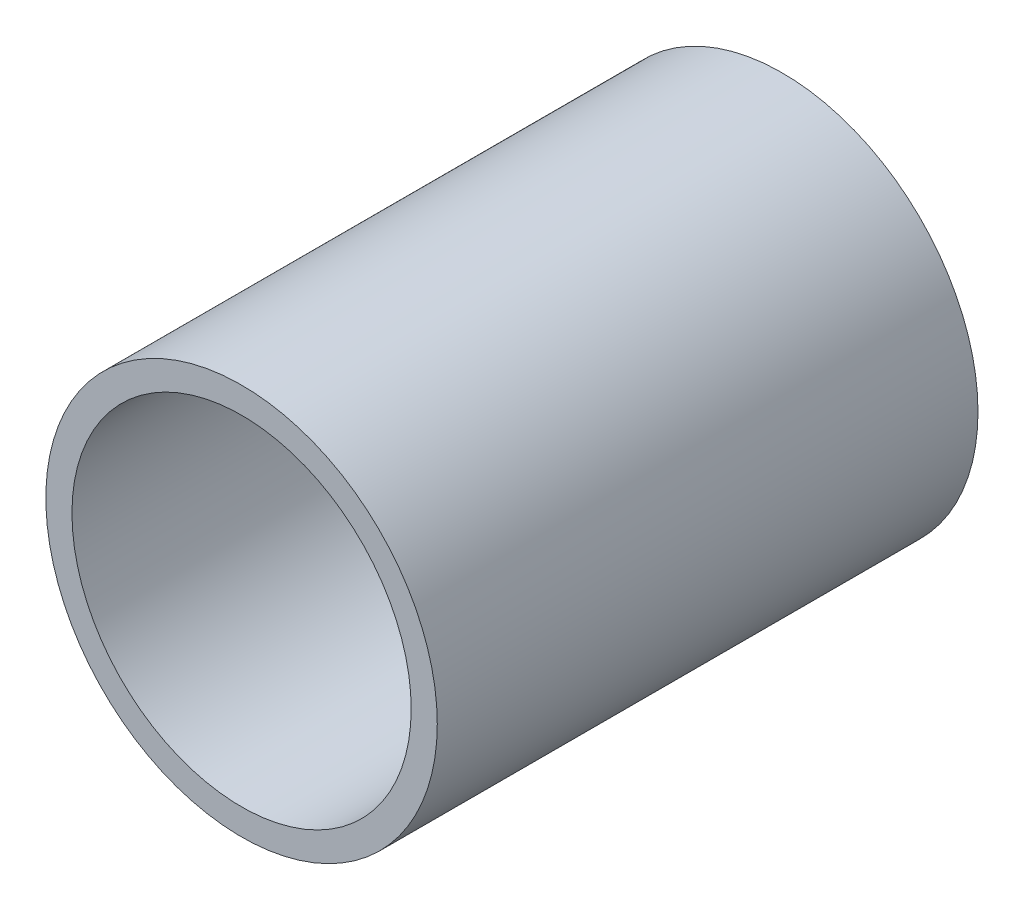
ISO-10303-21;
HEADER;
FILE_DESCRIPTION(('STEP AP214'),'2;1');
FILE_NAME('part.step','',(''),(''),'','','');
FILE_SCHEMA(('AUTOMOTIVE_DESIGN { 1 0 10303 214 1 1 1 1 }'));
ENDSEC;
DATA;
#1=APPLICATION_CONTEXT('core data for automotive mechanical design processes');
#2=APPLICATION_PROTOCOL_DEFINITION('international standard','automotive_design',2000,#1);
#3=PRODUCT_CONTEXT('',#1,'mechanical');
#4=PRODUCT('Part','Part','',(#3));
#5=PRODUCT_RELATED_PRODUCT_CATEGORY('part','',(#4));
#6=PRODUCT_DEFINITION_FORMATION('','',#4);
#7=PRODUCT_DEFINITION_CONTEXT('part definition',#1,'design');
#8=PRODUCT_DEFINITION('design','',#6,#7);
#9=PRODUCT_DEFINITION_SHAPE('','',#8);
#10=(LENGTH_UNIT() NAMED_UNIT(*) SI_UNIT(.MILLI.,.METRE.));
#11=(NAMED_UNIT(*) PLANE_ANGLE_UNIT() SI_UNIT($,.RADIAN.));
#12=(NAMED_UNIT(*) SI_UNIT($,.STERADIAN.) SOLID_ANGLE_UNIT());
#13=UNCERTAINTY_MEASURE_WITH_UNIT(LENGTH_MEASURE(1.E-05),#10,'distance_accuracy_value','');
#14=(GEOMETRIC_REPRESENTATION_CONTEXT(3) GLOBAL_UNCERTAINTY_ASSIGNED_CONTEXT((#13)) GLOBAL_UNIT_ASSIGNED_CONTEXT((#10,
#11,#12)) REPRESENTATION_CONTEXT('',''));
#15=CARTESIAN_POINT('',(0.,0.,0.));
#16=DIRECTION('',(0.,0.,1.));
#17=DIRECTION('',(1.,0.,0.));
#18=AXIS2_PLACEMENT_3D('',#15,#16,#17);
#19=CARTESIAN_POINT('',(0.,0.,263.144));
#20=DIRECTION('',(0.,0.,1.));
#21=DIRECTION('',(1.,0.,0.));
#22=AXIS2_PLACEMENT_3D('',#19,#20,#21);
#23=PLANE('',#22);
#24=CARTESIAN_POINT('',(0.,0.,263.144));
#25=DIRECTION('',(0.,0.,1.));
#26=DIRECTION('',(1.,0.,0.));
#27=AXIS2_PLACEMENT_3D('',#24,#25,#26);
#28=CIRCLE('',#27,95.25);
#29=CARTESIAN_POINT('',(95.25,0.,263.144));
#30=VERTEX_POINT('',#29);
#31=EDGE_CURVE('E10',#30,#30,#28,.T.);
#32=ORIENTED_EDGE('',*,*,#31,.T.);
#33=EDGE_LOOP('',(#32));
#34=FACE_BOUND('',#33,.T.);
#35=CARTESIAN_POINT('',(0.,0.,263.144));
#36=DIRECTION('',(0.,0.,1.));
#37=DIRECTION('',(1.,0.,0.));
#38=AXIS2_PLACEMENT_3D('',#35,#36,#37);
#39=CIRCLE('',#38,82.55);
#40=CARTESIAN_POINT('',(82.55,0.,263.144));
#41=VERTEX_POINT('',#40);
#42=EDGE_CURVE('E43',#41,#41,#39,.T.);
#43=ORIENTED_EDGE('',*,*,#42,.F.);
#44=EDGE_LOOP('',(#43));
#45=FACE_BOUND('',#44,.T.);
#46=ADVANCED_FACE('F32',(#34,#45),#23,.T.);
#47=CARTESIAN_POINT('',(0.,0.,0.));
#48=DIRECTION('',(0.,0.,1.));
#49=DIRECTION('',(1.,0.,0.));
#50=AXIS2_PLACEMENT_3D('',#47,#48,#49);
#51=PLANE('',#50);
#52=CARTESIAN_POINT('',(0.,0.,0.));
#53=DIRECTION('',(0.,0.,1.));
#54=DIRECTION('',(1.,0.,0.));
#55=AXIS2_PLACEMENT_3D('',#52,#53,#54);
#56=CIRCLE('',#55,95.25);
#57=CARTESIAN_POINT('',(95.25,0.,0.));
#58=VERTEX_POINT('',#57);
#59=EDGE_CURVE('E39',#58,#58,#56,.T.);
#60=ORIENTED_EDGE('',*,*,#59,.F.);
#61=EDGE_LOOP('',(#60));
#62=FACE_BOUND('',#61,.T.);
#63=CARTESIAN_POINT('',(0.,0.,0.));
#64=DIRECTION('',(0.,0.,1.));
#65=DIRECTION('',(1.,0.,0.));
#66=AXIS2_PLACEMENT_3D('',#63,#64,#65);
#67=CIRCLE('',#66,82.55);
#68=CARTESIAN_POINT('',(82.55,0.,0.));
#69=VERTEX_POINT('',#68);
#70=EDGE_CURVE('E47',#69,#69,#67,.T.);
#71=ORIENTED_EDGE('',*,*,#70,.T.);
#72=EDGE_LOOP('',(#71));
#73=FACE_BOUND('',#72,.T.);
#74=ADVANCED_FACE('F53',(#62,#73),#51,.F.);
#75=CARTESIAN_POINT('',(0.,0.,263.144));
#76=DIRECTION('',(0.,0.,-1.));
#77=DIRECTION('',(-1.,0.,0.));
#78=AXIS2_PLACEMENT_3D('',#75,#76,#77);
#79=CYLINDRICAL_SURFACE('',#78,95.25);
#80=ORIENTED_EDGE('',*,*,#31,.F.);
#81=EDGE_LOOP('',(#80));
#82=FACE_BOUND('',#81,.T.);
#83=ORIENTED_EDGE('',*,*,#59,.T.);
#84=EDGE_LOOP('',(#83));
#85=FACE_BOUND('',#84,.T.);
#86=ADVANCED_FACE('F34',(#82,#85),#79,.T.);
#87=CARTESIAN_POINT('',(0.,0.,263.144));
#88=DIRECTION('',(0.,0.,-1.));
#89=DIRECTION('',(-1.,0.,0.));
#90=AXIS2_PLACEMENT_3D('',#87,#88,#89);
#91=CYLINDRICAL_SURFACE('',#90,82.55);
#92=ORIENTED_EDGE('',*,*,#42,.T.);
#93=EDGE_LOOP('',(#92));
#94=FACE_BOUND('',#93,.T.);
#95=ORIENTED_EDGE('',*,*,#70,.F.);
#96=EDGE_LOOP('',(#95));
#97=FACE_BOUND('',#96,.T.);
#98=ADVANCED_FACE('F55',(#94,#97),#91,.F.);
#99=CLOSED_SHELL('',(#46,#74,#86,#98));
#100=MANIFOLD_SOLID_BREP('B2',#99);
#101=ADVANCED_BREP_SHAPE_REPRESENTATION('',(#18,#100),#14);
#102=SHAPE_DEFINITION_REPRESENTATION(#9,#101);
ENDSEC;
END-ISO-10303-21;
